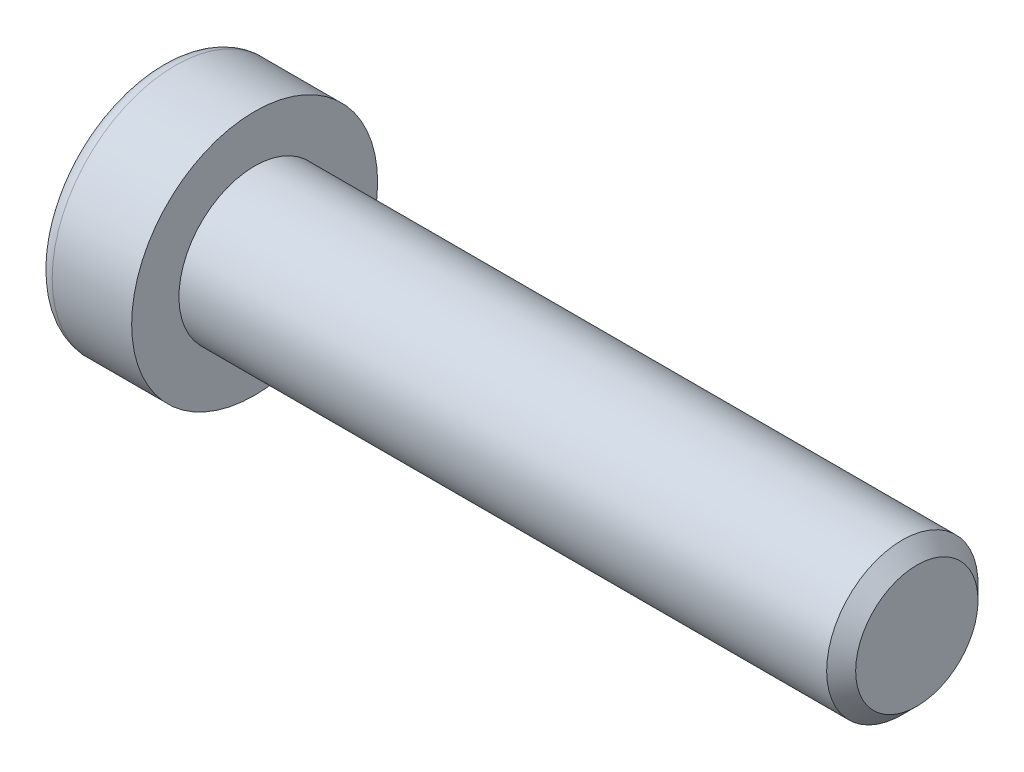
ISO-10303-21;
HEADER;
FILE_DESCRIPTION(('STEP AP214'),'2;1');
FILE_NAME('part.step','',(''),(''),'','','');
FILE_SCHEMA(('AUTOMOTIVE_DESIGN { 1 0 10303 214 1 1 1 1 }'));
ENDSEC;
DATA;
#1=APPLICATION_CONTEXT('core data for automotive mechanical design processes');
#2=APPLICATION_PROTOCOL_DEFINITION('international standard','automotive_design',2000,#1);
#3=PRODUCT_CONTEXT('',#1,'mechanical');
#4=PRODUCT('Part','Part','',(#3));
#5=PRODUCT_RELATED_PRODUCT_CATEGORY('part','',(#4));
#6=PRODUCT_DEFINITION_FORMATION('','',#4);
#7=PRODUCT_DEFINITION_CONTEXT('part definition',#1,'design');
#8=PRODUCT_DEFINITION('design','',#6,#7);
#9=PRODUCT_DEFINITION_SHAPE('','',#8);
#10=(LENGTH_UNIT() NAMED_UNIT(*) SI_UNIT(.MILLI.,.METRE.));
#11=(NAMED_UNIT(*) PLANE_ANGLE_UNIT() SI_UNIT($,.RADIAN.));
#12=(NAMED_UNIT(*) SI_UNIT($,.STERADIAN.) SOLID_ANGLE_UNIT());
#13=UNCERTAINTY_MEASURE_WITH_UNIT(LENGTH_MEASURE(1.E-05),#10,'distance_accuracy_value','');
#14=(GEOMETRIC_REPRESENTATION_CONTEXT(3) GLOBAL_UNCERTAINTY_ASSIGNED_CONTEXT((#13)) GLOBAL_UNIT_ASSIGNED_CONTEXT((#10,
#11,#12)) REPRESENTATION_CONTEXT('',''));
#15=CARTESIAN_POINT('',(0.,0.,0.));
#16=DIRECTION('',(0.,0.,1.));
#17=DIRECTION('',(1.,0.,0.));
#18=AXIS2_PLACEMENT_3D('',#15,#16,#17);
#19=CARTESIAN_POINT('',(-1.21000000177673,0.,0.));
#20=DIRECTION('',(-1.,0.,0.));
#21=DIRECTION('',(0.,0.,1.));
#22=AXIS2_PLACEMENT_3D('',#19,#20,#21);
#23=CONICAL_SURFACE('',#22,2.9040718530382,1.04719754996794);
#24=CARTESIAN_POINT('',(0.466666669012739,-1.13686837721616E-10,0.));
#25=VERTEX_POINT('',#24);
#26=VERTEX_LOOP('',#25);
#27=FACE_BOUND('',#26,.T.);
#28=CARTESIAN_POINT('',(-1.20000000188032,2.50000000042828,1.44337567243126));
#29=CARTESIAN_POINT('',(-1.16336943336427,2.50000000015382,1.31652043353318));
#30=CARTESIAN_POINT('',(-1.13005584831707,2.50000000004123,1.18857018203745));
#31=CARTESIAN_POINT('',(-1.07190798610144,2.49999999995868,0.930454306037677));
#32=CARTESIAN_POINT('',(-1.04709427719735,2.49999999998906,0.800284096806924));
#33=CARTESIAN_POINT('',(-1.00846995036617,2.50000000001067,0.541556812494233));
#34=CARTESIAN_POINT('',(-0.994402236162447,2.50000000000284,0.413039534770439));
#35=CARTESIAN_POINT('',(-0.977611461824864,2.49999999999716,0.155400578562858));
#36=CARTESIAN_POINT('',(-0.974874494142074,2.49999999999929,0.0262798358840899));
#37=CARTESIAN_POINT('',(-0.980582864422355,2.50000000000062,-0.21496841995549));
#38=CARTESIAN_POINT('',(-0.987626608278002,2.50000000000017,-0.327132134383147));
#39=CARTESIAN_POINT('',(-1.00994662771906,2.49999999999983,-0.550728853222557));
#40=CARTESIAN_POINT('',(-1.02523052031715,2.49999999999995,-0.66216108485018));
#41=CARTESIAN_POINT('',(-1.06343729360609,2.50000000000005,-0.886218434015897));
#42=CARTESIAN_POINT('',(-1.08652205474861,2.50000000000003,-0.998815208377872));
#43=CARTESIAN_POINT('',(-1.13891470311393,2.49999999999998,-1.2223298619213));
#44=CARTESIAN_POINT('',(-1.16821028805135,2.49999999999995,-1.33325060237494));
#45=CARTESIAN_POINT('',(-1.20000000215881,2.5,-1.44337567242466));
#46=B_SPLINE_CURVE_WITH_KNOTS('',3,(#28,#29,#30,#31,#32,#33,#34,#35,#36,#37,#38,#39,#40,#41,#42,
#43,#44,#45),.UNSPECIFIED.,.F.,.F.,(4,2,2,2,2,2,2,2,4),(0.,0.396270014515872,0.793492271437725,
1.18088450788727,1.56780111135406,1.90463472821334,2.24178024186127,2.58640202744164,
2.93034746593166),.UNSPECIFIED.);
#47=CARTESIAN_POINT('',(-1.20000000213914,2.49999999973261,1.44337567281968));
#48=VERTEX_POINT('',#47);
#49=CARTESIAN_POINT('',(-1.20000000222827,2.5,-1.44337567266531));
#50=VERTEX_POINT('',#49);
#51=EDGE_CURVE('E20',#48,#50,#46,.T.);
#52=ORIENTED_EDGE('',*,*,#51,.T.);
#53=CARTESIAN_POINT('',(-1.20000000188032,2.49999999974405,-1.44337567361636));
#54=CARTESIAN_POINT('',(-1.16336943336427,2.39014014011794,-1.50680329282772));
#55=CARTESIAN_POINT('',(-1.13005584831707,2.27933197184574,-1.57077841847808));
#56=CARTESIAN_POINT('',(-1.07190798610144,2.05579706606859,-1.69983635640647));
#57=CARTESIAN_POINT('',(-1.04709427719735,1.94306635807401,-1.76492146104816));
#58=CARTESIAN_POINT('',(-1.00846995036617,1.71900195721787,-1.89428510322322));
#59=CARTESIAN_POINT('',(-0.994402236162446,1.60770272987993,-1.95854374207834));
#60=CARTESIAN_POINT('',(-0.977611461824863,1.38458084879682,-2.08736322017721));
#61=CARTESIAN_POINT('',(-0.974874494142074,1.27275900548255,-2.15192359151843));
#62=CARTESIAN_POINT('',(-0.980582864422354,1.06383188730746,-2.27254771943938));
#63=CARTESIAN_POINT('',(-0.987626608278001,0.966695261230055,-2.32862957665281));
#64=CARTESIAN_POINT('',(-1.00994662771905,0.773054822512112,-2.44042793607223));
#65=CARTESIAN_POINT('',(-1.02523052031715,0.676551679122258,-2.49614405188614));
#66=CARTESIAN_POINT('',(-1.06343729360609,0.482512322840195,-2.60817272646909));
#67=CARTESIAN_POINT('',(-1.08652205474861,0.385000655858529,-2.66447111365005));
#68=CARTESIAN_POINT('',(-1.13891470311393,0.191431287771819,-2.77622844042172));
#69=CARTESIAN_POINT('',(-1.16821028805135,0.09537110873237,-2.83168881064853));
#70=CARTESIAN_POINT('',(-1.20000000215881,4.75795613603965E-10,-2.88675134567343));
#71=B_SPLINE_CURVE_WITH_KNOTS('',3,(#53,#54,#55,#56,#57,#58,#59,#60,#61,#62,#63,#64,#65,#66,#67,
#68,#69,#70),.UNSPECIFIED.,.F.,.F.,(4,2,2,2,2,2,2,2,4),(0.,0.396270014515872,0.793492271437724,
1.18088450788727,1.56780111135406,1.90463472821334,2.24178024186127,2.58640202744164,
2.93034746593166),.UNSPECIFIED.);
#72=CARTESIAN_POINT('',(-1.20000000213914,0.,-2.88675134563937));
#73=VERTEX_POINT('',#72);
#74=EDGE_CURVE('E80',#50,#73,#71,.T.);
#75=ORIENTED_EDGE('',*,*,#74,.T.);
#76=CARTESIAN_POINT('',(-1.20000000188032,-6.84219602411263E-10,-2.88675134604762));
#77=CARTESIAN_POINT('',(-1.16336943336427,-0.109859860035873,-2.8233237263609));
#78=CARTESIAN_POINT('',(-1.13005584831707,-0.220668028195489,-2.75934860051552));
#79=CARTESIAN_POINT('',(-1.07190798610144,-0.444202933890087,-2.63029066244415));
#80=CARTESIAN_POINT('',(-1.04709427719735,-0.556933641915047,-2.56520555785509));
#81=CARTESIAN_POINT('',(-1.00846995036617,-0.780998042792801,-2.43584191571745));
#82=CARTESIAN_POINT('',(-0.994402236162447,-0.892297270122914,-2.37158327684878));
#83=CARTESIAN_POINT('',(-0.977611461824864,-1.11541915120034,-2.24276379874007));
#84=CARTESIAN_POINT('',(-0.974874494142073,-1.22724099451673,-2.17820342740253));
#85=CARTESIAN_POINT('',(-0.980582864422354,-1.43616811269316,-2.05757929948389));
#86=CARTESIAN_POINT('',(-0.987626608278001,-1.53330473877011,-2.00149744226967));
#87=CARTESIAN_POINT('',(-1.00994662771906,-1.72694517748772,-1.88969908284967));
#88=CARTESIAN_POINT('',(-1.02523052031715,-1.82344832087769,-1.83398296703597));
#89=CARTESIAN_POINT('',(-1.06343729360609,-2.01748767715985,-1.72195429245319));
#90=CARTESIAN_POINT('',(-1.08652205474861,-2.1149993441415,-1.66565590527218));
#91=CARTESIAN_POINT('',(-1.13891470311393,-2.30856871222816,-1.55389857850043));
#92=CARTESIAN_POINT('',(-1.16821028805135,-2.40462889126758,-1.49843820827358));
#93=CARTESIAN_POINT('',(-1.20000000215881,-2.49999999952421,-1.44337567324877));
#94=B_SPLINE_CURVE_WITH_KNOTS('',3,(#76,#77,#78,#79,#80,#81,#82,#83,#84,#85,#86,#87,#88,#89,#90,
#91,#92,#93),.UNSPECIFIED.,.F.,.F.,(4,2,2,2,2,2,2,2,4),(0.,0.396270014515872,0.793492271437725,
1.18088450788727,1.56780111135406,1.90463472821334,2.24178024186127,2.58640202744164,
2.93034746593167),.UNSPECIFIED.);
#95=CARTESIAN_POINT('',(-1.20000000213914,-2.49999999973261,-1.44337567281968));
#96=VERTEX_POINT('',#95);
#97=EDGE_CURVE('E105',#73,#96,#94,.T.);
#98=ORIENTED_EDGE('',*,*,#97,.T.);
#99=CARTESIAN_POINT('',(-1.20000000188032,-2.50000000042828,-1.44337567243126));
#100=CARTESIAN_POINT('',(-1.16336943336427,-2.50000000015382,-1.31652043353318));
#101=CARTESIAN_POINT('',(-1.13005584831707,-2.50000000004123,-1.18857018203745));
#102=CARTESIAN_POINT('',(-1.07190798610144,-2.49999999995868,-0.93045430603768));
#103=CARTESIAN_POINT('',(-1.04709427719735,-2.49999999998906,-0.800284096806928));
#104=CARTESIAN_POINT('',(-1.00846995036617,-2.50000000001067,-0.541556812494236));
#105=CARTESIAN_POINT('',(-0.994402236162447,-2.50000000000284,-0.413039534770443));
#106=CARTESIAN_POINT('',(-0.977611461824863,-2.49999999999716,-0.155400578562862));
#107=CARTESIAN_POINT('',(-0.974874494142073,-2.49999999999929,-0.0262798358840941));
#108=CARTESIAN_POINT('',(-0.980582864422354,-2.50000000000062,0.214968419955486));
#109=CARTESIAN_POINT('',(-0.987626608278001,-2.50000000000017,0.327132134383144));
#110=CARTESIAN_POINT('',(-1.00994662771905,-2.49999999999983,0.550728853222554));
#111=CARTESIAN_POINT('',(-1.02523052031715,-2.49999999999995,0.662161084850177));
#112=CARTESIAN_POINT('',(-1.06343729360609,-2.50000000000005,0.886218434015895));
#113=CARTESIAN_POINT('',(-1.08652205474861,-2.50000000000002,0.99881520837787));
#114=CARTESIAN_POINT('',(-1.13891470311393,-2.49999999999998,1.2223298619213));
#115=CARTESIAN_POINT('',(-1.16821028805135,-2.49999999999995,1.33325060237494));
#116=CARTESIAN_POINT('',(-1.20000000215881,-2.5,1.44337567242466));
#117=B_SPLINE_CURVE_WITH_KNOTS('',3,(#99,#100,#101,#102,#103,#104,#105,#106,#107,#108,#109,#110,
#111,#112,#113,#114,#115,#116),.UNSPECIFIED.,.F.,.F.,(4,2,2,2,2,2,2,2,4),(0.,0.396270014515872,
0.793492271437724,1.18088450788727,1.56780111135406,1.90463472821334,2.24178024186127,
2.58640202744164,2.93034746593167),.UNSPECIFIED.);
#118=CARTESIAN_POINT('',(-1.20000000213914,-2.49999999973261,1.44337567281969));
#119=VERTEX_POINT('',#118);
#120=EDGE_CURVE('E129',#96,#119,#117,.T.);
#121=ORIENTED_EDGE('',*,*,#120,.T.);
#122=CARTESIAN_POINT('',(-1.20000000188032,-2.49999999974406,1.44337567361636));
#123=CARTESIAN_POINT('',(-1.16336943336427,-2.39014014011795,1.50680329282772));
#124=CARTESIAN_POINT('',(-1.13005584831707,-2.27933197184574,1.57077841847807));
#125=CARTESIAN_POINT('',(-1.07190798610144,-2.05579706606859,1.69983635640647));
#126=CARTESIAN_POINT('',(-1.04709427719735,-1.94306635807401,1.76492146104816));
#127=CARTESIAN_POINT('',(-1.00846995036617,-1.71900195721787,1.89428510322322));
#128=CARTESIAN_POINT('',(-0.994402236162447,-1.60770272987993,1.95854374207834));
#129=CARTESIAN_POINT('',(-0.977611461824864,-1.38458084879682,2.08736322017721));
#130=CARTESIAN_POINT('',(-0.974874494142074,-1.27275900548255,2.15192359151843));
#131=CARTESIAN_POINT('',(-0.980582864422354,-1.06383188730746,2.27254771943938));
#132=CARTESIAN_POINT('',(-0.987626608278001,-0.966695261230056,2.32862957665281));
#133=CARTESIAN_POINT('',(-1.00994662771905,-0.773054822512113,2.44042793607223));
#134=CARTESIAN_POINT('',(-1.02523052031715,-0.676551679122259,2.49614405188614));
#135=CARTESIAN_POINT('',(-1.06343729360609,-0.482512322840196,2.60817272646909));
#136=CARTESIAN_POINT('',(-1.08652205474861,-0.385000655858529,2.66447111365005));
#137=CARTESIAN_POINT('',(-1.13891470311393,-0.19143128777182,2.77622844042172));
#138=CARTESIAN_POINT('',(-1.16821028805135,-0.0953711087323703,2.83168881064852));
#139=CARTESIAN_POINT('',(-1.20000000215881,-4.75795563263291E-10,2.88675134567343));
#140=B_SPLINE_CURVE_WITH_KNOTS('',3,(#122,#123,#124,#125,#126,#127,#128,#129,#130,#131,#132,
#133,#134,#135,#136,#137,#138,#139),.UNSPECIFIED.,.F.,.F.,(4,2,2,2,2,2,2,2,4),(0.,
0.396270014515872,0.793492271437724,1.18088450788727,1.56780111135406,1.90463472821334,
2.24178024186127,2.58640202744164,2.93034746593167),.UNSPECIFIED.);
#141=CARTESIAN_POINT('',(-1.20000000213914,0.,2.88675134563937));
#142=VERTEX_POINT('',#141);
#143=EDGE_CURVE('E137',#119,#142,#140,.T.);
#144=ORIENTED_EDGE('',*,*,#143,.T.);
#145=CARTESIAN_POINT('',(-1.20000000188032,6.84218568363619E-10,2.88675134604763));
#146=CARTESIAN_POINT('',(-1.16336943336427,0.109859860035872,2.8233237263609));
#147=CARTESIAN_POINT('',(-1.13005584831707,0.220668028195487,2.75934860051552));
#148=CARTESIAN_POINT('',(-1.07190798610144,0.444202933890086,2.63029066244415));
#149=CARTESIAN_POINT('',(-1.04709427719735,0.556933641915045,2.56520555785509));
#150=CARTESIAN_POINT('',(-1.00846995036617,0.7809980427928,2.43584191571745));
#151=CARTESIAN_POINT('',(-0.994402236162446,0.892297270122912,2.37158327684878));
#152=CARTESIAN_POINT('',(-0.977611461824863,1.11541915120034,2.24276379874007));
#153=CARTESIAN_POINT('',(-0.974874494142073,1.22724099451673,2.17820342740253));
#154=CARTESIAN_POINT('',(-0.980582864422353,1.43616811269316,2.05757929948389));
#155=CARTESIAN_POINT('',(-0.987626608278,1.53330473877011,2.00149744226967));
#156=CARTESIAN_POINT('',(-1.00994662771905,1.72694517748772,1.88969908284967));
#157=CARTESIAN_POINT('',(-1.02523052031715,1.82344832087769,1.83398296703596));
#158=CARTESIAN_POINT('',(-1.06343729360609,2.01748767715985,1.72195429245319));
#159=CARTESIAN_POINT('',(-1.08652205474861,2.1149993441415,1.66565590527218));
#160=CARTESIAN_POINT('',(-1.13891470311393,2.30856871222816,1.55389857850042));
#161=CARTESIAN_POINT('',(-1.16821028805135,2.40462889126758,1.49843820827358));
#162=CARTESIAN_POINT('',(-1.2000000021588,2.49999999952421,1.44337567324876));
#163=B_SPLINE_CURVE_WITH_KNOTS('',3,(#145,#146,#147,#148,#149,#150,#151,#152,#153,#154,#155,
#156,#157,#158,#159,#160,#161,#162),.UNSPECIFIED.,.F.,.F.,(4,2,2,2,2,2,2,2,4),(0.,
0.396270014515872,0.793492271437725,1.18088450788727,1.56780111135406,1.90463472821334,
2.24178024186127,2.58640202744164,2.93034746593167),.UNSPECIFIED.);
#164=EDGE_CURVE('E82',#142,#48,#163,.T.);
#165=ORIENTED_EDGE('',*,*,#164,.T.);
#166=EDGE_LOOP('',(#52,#75,#98,#121,#144,#165));
#167=FACE_BOUND('',#166,.T.);
#168=ADVANCED_FACE('F16',(#27,#167),#23,.F.);
#169=CARTESIAN_POINT('',(-5.,2.5,1.44337567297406));
#170=DIRECTION('',(0.,1.,0.));
#171=DIRECTION('',(0.,0.,1.));
#172=AXIS2_PLACEMENT_3D('',#169,#170,#171);
#173=PLANE('',#172);
#174=DIRECTION('',(1.,0.,0.));
#175=VECTOR('',#174,1.);
#176=CARTESIAN_POINT('',(-5.,2.5,1.44337567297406));
#177=LINE('',#176,#175);
#178=CARTESIAN_POINT('',(-5.,2.5,1.44337567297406));
#179=VERTEX_POINT('',#178);
#180=EDGE_CURVE('E84',#48,#179,#177,.F.);
#181=ORIENTED_EDGE('',*,*,#180,.T.);
#182=DIRECTION('',(0.,0.,1.));
#183=VECTOR('',#182,1.);
#184=CARTESIAN_POINT('',(-5.,2.5,0.));
#185=LINE('',#184,#183);
#186=CARTESIAN_POINT('',(-5.,2.5,-1.44337567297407));
#187=VERTEX_POINT('',#186);
#188=EDGE_CURVE('E89',#187,#179,#185,.T.);
#189=ORIENTED_EDGE('',*,*,#188,.F.);
#190=DIRECTION('',(1.,0.,0.));
#191=VECTOR('',#190,1.);
#192=CARTESIAN_POINT('',(-5.,2.5,-1.44337567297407));
#193=LINE('',#192,#191);
#194=EDGE_CURVE('E87',#187,#50,#193,.T.);
#195=ORIENTED_EDGE('',*,*,#194,.T.);
#196=ORIENTED_EDGE('',*,*,#51,.F.);
#197=EDGE_LOOP('',(#181,#189,#195,#196));
#198=FACE_BOUND('',#197,.T.);
#199=ADVANCED_FACE('F76',(#198),#173,.F.);
#200=CARTESIAN_POINT('',(-5.,0.,2.88675134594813));
#201=DIRECTION('',(0.,0.500000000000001,0.866025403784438));
#202=DIRECTION('',(0.,-0.866025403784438,0.500000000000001));
#203=AXIS2_PLACEMENT_3D('',#200,#201,#202);
#204=PLANE('',#203);
#205=DIRECTION('',(1.,0.,0.));
#206=VECTOR('',#205,1.);
#207=CARTESIAN_POINT('',(-5.,0.,2.88675134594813));
#208=LINE('',#207,#206);
#209=CARTESIAN_POINT('',(-5.,0.,2.88675134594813));
#210=VERTEX_POINT('',#209);
#211=EDGE_CURVE('E141',#142,#210,#208,.F.);
#212=ORIENTED_EDGE('',*,*,#211,.T.);
#213=DIRECTION('',(0.,-0.866025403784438,0.500000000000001));
#214=VECTOR('',#213,1.);
#215=CARTESIAN_POINT('',(-5.,2.5,1.44337567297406));
#216=LINE('',#215,#214);
#217=EDGE_CURVE('E95',#179,#210,#216,.T.);
#218=ORIENTED_EDGE('',*,*,#217,.F.);
#219=ORIENTED_EDGE('',*,*,#180,.F.);
#220=ORIENTED_EDGE('',*,*,#164,.F.);
#221=EDGE_LOOP('',(#212,#218,#219,#220));
#222=FACE_BOUND('',#221,.T.);
#223=ADVANCED_FACE('F145',(#222),#204,.F.);
#224=CARTESIAN_POINT('',(-5.,-2.5,1.44337567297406));
#225=DIRECTION('',(0.,-0.5,0.866025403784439));
#226=DIRECTION('',(0.,-0.866025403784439,-0.5));
#227=AXIS2_PLACEMENT_3D('',#224,#225,#226);
#228=PLANE('',#227);
#229=DIRECTION('',(1.,0.,0.));
#230=VECTOR('',#229,1.);
#231=CARTESIAN_POINT('',(-5.,-2.5,1.44337567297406));
#232=LINE('',#231,#230);
#233=CARTESIAN_POINT('',(-5.,-2.5,1.44337567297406));
#234=VERTEX_POINT('',#233);
#235=EDGE_CURVE('E136',#119,#234,#232,.F.);
#236=ORIENTED_EDGE('',*,*,#235,.T.);
#237=DIRECTION('',(0.,-0.866025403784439,-0.5));
#238=VECTOR('',#237,1.);
#239=CARTESIAN_POINT('',(-5.,0.,2.88675134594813));
#240=LINE('',#239,#238);
#241=EDGE_CURVE('E224',#210,#234,#240,.T.);
#242=ORIENTED_EDGE('',*,*,#241,.F.);
#243=ORIENTED_EDGE('',*,*,#211,.F.);
#244=ORIENTED_EDGE('',*,*,#143,.F.);
#245=EDGE_LOOP('',(#236,#242,#243,#244));
#246=FACE_BOUND('',#245,.T.);
#247=ADVANCED_FACE('F125',(#246),#228,.F.);
#248=CARTESIAN_POINT('',(-5.,-2.5,-1.44337567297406));
#249=DIRECTION('',(0.,-1.,0.));
#250=DIRECTION('',(0.,0.,-1.));
#251=AXIS2_PLACEMENT_3D('',#248,#249,#250);
#252=PLANE('',#251);
#253=DIRECTION('',(1.,0.,0.));
#254=VECTOR('',#253,1.);
#255=CARTESIAN_POINT('',(-5.,-2.5,-1.44337567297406));
#256=LINE('',#255,#254);
#257=CARTESIAN_POINT('',(-5.,-2.5,-1.44337567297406));
#258=VERTEX_POINT('',#257);
#259=EDGE_CURVE('E135',#96,#258,#256,.F.);
#260=ORIENTED_EDGE('',*,*,#259,.T.);
#261=DIRECTION('',(0.,0.,1.));
#262=VECTOR('',#261,1.);
#263=CARTESIAN_POINT('',(-5.,-2.5,0.));
#264=LINE('',#263,#262);
#265=EDGE_CURVE('E221',#234,#258,#264,.F.);
#266=ORIENTED_EDGE('',*,*,#265,.F.);
#267=ORIENTED_EDGE('',*,*,#235,.F.);
#268=ORIENTED_EDGE('',*,*,#120,.F.);
#269=EDGE_LOOP('',(#260,#266,#267,#268));
#270=FACE_BOUND('',#269,.T.);
#271=ADVANCED_FACE('F121',(#270),#252,.F.);
#272=CARTESIAN_POINT('',(-5.,0.,-2.88675134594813));
#273=DIRECTION('',(0.,-0.5,-0.866025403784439));
#274=DIRECTION('',(0.,0.866025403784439,-0.5));
#275=AXIS2_PLACEMENT_3D('',#272,#273,#274);
#276=PLANE('',#275);
#277=DIRECTION('',(1.,0.,0.));
#278=VECTOR('',#277,1.);
#279=CARTESIAN_POINT('',(-5.,0.,-2.88675134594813));
#280=LINE('',#279,#278);
#281=CARTESIAN_POINT('',(-5.,0.,-2.88675134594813));
#282=VERTEX_POINT('',#281);
#283=EDGE_CURVE('E38',#73,#282,#280,.F.);
#284=ORIENTED_EDGE('',*,*,#283,.T.);
#285=DIRECTION('',(0.,0.866025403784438,-0.500000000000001));
#286=VECTOR('',#285,1.);
#287=CARTESIAN_POINT('',(-5.,-2.5,-1.44337567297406));
#288=LINE('',#287,#286);
#289=EDGE_CURVE('E218',#258,#282,#288,.T.);
#290=ORIENTED_EDGE('',*,*,#289,.F.);
#291=ORIENTED_EDGE('',*,*,#259,.F.);
#292=ORIENTED_EDGE('',*,*,#97,.F.);
#293=EDGE_LOOP('',(#284,#290,#291,#292));
#294=FACE_BOUND('',#293,.T.);
#295=ADVANCED_FACE('F115',(#294),#276,.F.);
#296=CARTESIAN_POINT('',(-5.,2.5,-1.44337567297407));
#297=DIRECTION('',(0.,0.5,-0.866025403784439));
#298=DIRECTION('',(0.,0.866025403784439,0.5));
#299=AXIS2_PLACEMENT_3D('',#296,#297,#298);
#300=PLANE('',#299);
#301=ORIENTED_EDGE('',*,*,#194,.F.);
#302=DIRECTION('',(0.,0.866025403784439,0.5));
#303=VECTOR('',#302,1.);
#304=CARTESIAN_POINT('',(-5.,0.,-2.88675134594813));
#305=LINE('',#304,#303);
#306=EDGE_CURVE('E216',#282,#187,#305,.T.);
#307=ORIENTED_EDGE('',*,*,#306,.F.);
#308=ORIENTED_EDGE('',*,*,#283,.F.);
#309=ORIENTED_EDGE('',*,*,#74,.F.);
#310=EDGE_LOOP('',(#301,#307,#308,#309));
#311=FACE_BOUND('',#310,.T.);
#312=ADVANCED_FACE('F93',(#311),#300,.F.);
#313=CARTESIAN_POINT('',(-5.,4.69337567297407,0.));
#314=DIRECTION('',(-1.,0.,0.));
#315=DIRECTION('',(0.,0.,1.));
#316=AXIS2_PLACEMENT_3D('',#313,#314,#315);
#317=PLANE('',#316);
#318=ORIENTED_EDGE('',*,*,#289,.T.);
#319=ORIENTED_EDGE('',*,*,#306,.T.);
#320=ORIENTED_EDGE('',*,*,#188,.T.);
#321=ORIENTED_EDGE('',*,*,#217,.T.);
#322=ORIENTED_EDGE('',*,*,#241,.T.);
#323=ORIENTED_EDGE('',*,*,#265,.T.);
#324=EDGE_LOOP('',(#318,#319,#320,#321,#322,#323));
#325=FACE_BOUND('',#324,.T.);
#326=CARTESIAN_POINT('',(-5.,0.,0.));
#327=DIRECTION('',(1.,0.,0.));
#328=DIRECTION('',(0.,1.,0.));
#329=AXIS2_PLACEMENT_3D('',#326,#327,#328);
#330=CIRCLE('',#329,5.7);
#331=CARTESIAN_POINT('',(-5.,5.7,0.));
#332=VERTEX_POINT('',#331);
#333=EDGE_CURVE('E193',#332,#332,#330,.T.);
#334=ORIENTED_EDGE('',*,*,#333,.F.);
#335=EDGE_LOOP('',(#334));
#336=FACE_BOUND('',#335,.T.);
#337=ADVANCED_FACE('F114',(#325,#336),#317,.T.);
#338=CARTESIAN_POINT('',(-4.2,0.,0.));
#339=DIRECTION('',(1.,0.,0.));
#340=DIRECTION('',(0.,0.,-1.));
#341=AXIS2_PLACEMENT_3D('',#338,#339,#340);
#342=TOROIDAL_SURFACE('',#341,5.7,0.8);
#343=CARTESIAN_POINT('',(-4.2,0.,0.));
#344=DIRECTION('',(1.,0.,0.));
#345=DIRECTION('',(0.,1.,0.));
#346=AXIS2_PLACEMENT_3D('',#343,#344,#345);
#347=CIRCLE('',#346,6.5);
#348=CARTESIAN_POINT('',(-4.2,6.5,0.));
#349=VERTEX_POINT('',#348);
#350=EDGE_CURVE('E234',#349,#349,#347,.T.);
#351=ORIENTED_EDGE('',*,*,#350,.F.);
#352=EDGE_LOOP('',(#351));
#353=FACE_BOUND('',#352,.T.);
#354=ORIENTED_EDGE('',*,*,#333,.T.);
#355=EDGE_LOOP('',(#354));
#356=FACE_BOUND('',#355,.T.);
#357=ADVANCED_FACE('F177',(#353,#356),#342,.T.);
#358=CARTESIAN_POINT('',(-2.5,0.,0.));
#359=DIRECTION('',(1.,0.,0.));
#360=DIRECTION('',(0.,1.,0.));
#361=AXIS2_PLACEMENT_3D('',#358,#359,#360);
#362=CYLINDRICAL_SURFACE('',#361,6.5);
#363=ORIENTED_EDGE('',*,*,#350,.T.);
#364=EDGE_LOOP('',(#363));
#365=FACE_BOUND('',#364,.T.);
#366=CARTESIAN_POINT('',(0.,0.,0.));
#367=DIRECTION('',(1.,0.,0.));
#368=DIRECTION('',(0.,1.,0.));
#369=AXIS2_PLACEMENT_3D('',#366,#367,#368);
#370=CIRCLE('',#369,6.5);
#371=CARTESIAN_POINT('',(0.,6.5,0.));
#372=VERTEX_POINT('',#371);
#373=EDGE_CURVE('E103',#372,#372,#370,.T.);
#374=ORIENTED_EDGE('',*,*,#373,.F.);
#375=EDGE_LOOP('',(#374));
#376=FACE_BOUND('',#375,.T.);
#377=ADVANCED_FACE('F174',(#365,#376),#362,.T.);
#378=CARTESIAN_POINT('',(35.,2.,0.));
#379=DIRECTION('',(1.,0.,0.));
#380=DIRECTION('',(0.,0.,-1.));
#381=AXIS2_PLACEMENT_3D('',#378,#379,#380);
#382=PLANE('',#381);
#383=CARTESIAN_POINT('',(35.0000000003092,0.,0.));
#384=DIRECTION('',(-1.,0.,0.));
#385=DIRECTION('',(0.,0.,1.));
#386=AXIS2_PLACEMENT_3D('',#383,#384,#385);
#387=CIRCLE('',#386,3.23318750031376);
#388=CARTESIAN_POINT('',(35.0000000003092,0.,3.23318750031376));
#389=VERTEX_POINT('',#388);
#390=EDGE_CURVE('E230',#389,#389,#387,.T.);
#391=ORIENTED_EDGE('',*,*,#390,.F.);
#392=EDGE_LOOP('',(#391));
#393=FACE_BOUND('',#392,.T.);
#394=ADVANCED_FACE('F170',(#393),#382,.T.);
#395=CARTESIAN_POINT('',(0.,5.25,0.));
#396=DIRECTION('',(1.,0.,0.));
#397=DIRECTION('',(0.,0.,-1.));
#398=AXIS2_PLACEMENT_3D('',#395,#396,#397);
#399=PLANE('',#398);
#400=CARTESIAN_POINT('',(0.,0.,0.));
#401=DIRECTION('',(1.,0.,0.));
#402=DIRECTION('',(0.,1.,0.));
#403=AXIS2_PLACEMENT_3D('',#400,#401,#402);
#404=CIRCLE('',#403,4.);
#405=CARTESIAN_POINT('',(0.,4.,0.));
#406=VERTEX_POINT('',#405);
#407=EDGE_CURVE('E29',#406,#406,#404,.T.);
#408=ORIENTED_EDGE('',*,*,#407,.F.);
#409=EDGE_LOOP('',(#408));
#410=FACE_BOUND('',#409,.T.);
#411=ORIENTED_EDGE('',*,*,#373,.T.);
#412=EDGE_LOOP('',(#411));
#413=FACE_BOUND('',#412,.T.);
#414=ADVANCED_FACE('F163',(#410,#413),#399,.T.);
#415=CARTESIAN_POINT('',(34.2331874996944,0.,0.));
#416=DIRECTION('',(-1.,0.,0.));
#417=DIRECTION('',(0.,0.,1.));
#418=AXIS2_PLACEMENT_3D('',#415,#416,#417);
#419=CONICAL_SURFACE('',#418,3.99999999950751,0.78539816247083);
#420=ORIENTED_EDGE('',*,*,#390,.T.);
#421=EDGE_LOOP('',(#420));
#422=FACE_BOUND('',#421,.T.);
#423=CARTESIAN_POINT('',(34.2331875,0.,0.));
#424=DIRECTION('',(1.,0.,0.));
#425=DIRECTION('',(0.,1.,0.));
#426=AXIS2_PLACEMENT_3D('',#423,#424,#425);
#427=CIRCLE('',#426,4.);
#428=CARTESIAN_POINT('',(34.2331875,4.,0.));
#429=VERTEX_POINT('',#428);
#430=EDGE_CURVE('E11',#429,#429,#427,.F.);
#431=ORIENTED_EDGE('',*,*,#430,.F.);
#432=EDGE_LOOP('',(#431));
#433=FACE_BOUND('',#432,.T.);
#434=ADVANCED_FACE('F156',(#422,#433),#419,.T.);
#435=CARTESIAN_POINT('',(24.,0.,0.));
#436=DIRECTION('',(1.,0.,0.));
#437=DIRECTION('',(0.,1.,0.));
#438=AXIS2_PLACEMENT_3D('',#435,#436,#437);
#439=CYLINDRICAL_SURFACE('',#438,4.);
#440=ORIENTED_EDGE('',*,*,#430,.T.);
#441=EDGE_LOOP('',(#440));
#442=FACE_BOUND('',#441,.T.);
#443=ORIENTED_EDGE('',*,*,#407,.T.);
#444=EDGE_LOOP('',(#443));
#445=FACE_BOUND('',#444,.T.);
#446=ADVANCED_FACE('F154',(#442,#445),#439,.T.);
#447=CLOSED_SHELL('',(#168,#199,#223,#247,#271,#295,#312,#337,#357,#377,#394,#414,#434,#446));
#448=MANIFOLD_SOLID_BREP('B1',#447);
#449=ADVANCED_BREP_SHAPE_REPRESENTATION('',(#18,#448),#14);
#450=SHAPE_DEFINITION_REPRESENTATION(#9,#449);
ENDSEC;
END-ISO-10303-21;
